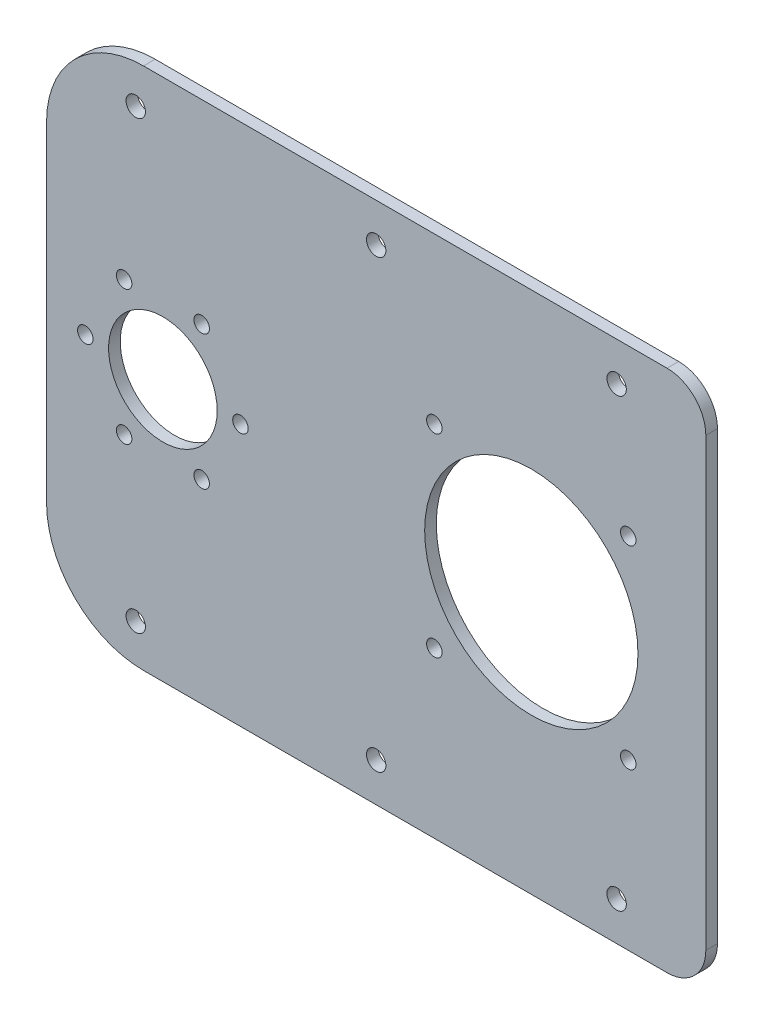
from build123d import *

# Parameters (mm, degrees)
SKETCH_1_W               = 170
SKETCH_1_H               = 135
SKETCH_1_R               = 14
EXTRUDE_1_DEPTH          = 1.5
CUT_EXTRUDE_1_DEPTH      = 109.551830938
CUT_EXTRUDE_1_DEPTH_BACK = 109.551830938
SKETCH_2_R               = 27.5
MM_1_D                   = 4
MM_1_DEPTH               = 6.5
MM_1_TIP                 = 1.201721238
SKETCH_5_R               = 2.5
SKETCH_5_R_2             = 2
CUT_EXTRUDE_2_DEPTH      = 109.582917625
FILLET_1_R               = 10
FILLET_2_R               = 25


with BuildPart() as part:
    # Sketch 1 → Extrude 1 (new, symmetric)
    with BuildSketch(Plane.XY):
        Rectangle(SKETCH_1_W, SKETCH_1_H)
        with Locations((-55, 0)):
            Circle(SKETCH_1_R, mode=Mode.SUBTRACT)
    extrude(amount=EXTRUDE_1_DEPTH, both=True)

    # Sketch 2 → Cut-Extrude 1 (cut, two sides: drawn at the far end of the back side and taken through both)
    with BuildSketch(Plane.XY.offset(-CUT_EXTRUDE_1_DEPTH_BACK)):
        with Locations((40, 0)):
            Circle(SKETCH_2_R)
    extrude(amount=CUT_EXTRUDE_1_DEPTH + CUT_EXTRUDE_1_DEPTH_BACK, mode=Mode.SUBTRACT)

    # mm _1
    with Locations(Plane(origin=(15, 25, 1.5), x_dir=(1, 0, 0), z_dir=(0, 0, 1))):
        with Locations((0, 0), (50, 0), (0, -50), (50, -50)):
            Hole(MM_1_D / 2, depth=MM_1_DEPTH)
            with Locations((0, 0, -(MM_1_DEPTH + MM_1_TIP / 2))):  # 118° drill point
                Cone(0, MM_1_D / 2, MM_1_TIP, mode=Mode.SUBTRACT)

    # Sketch 5 → Cut-Extrude 2 (cut, through all)
    with BuildSketch(Plane.XY.offset(1.5)):
        with Locations((62, 57.5)):
            Circle(SKETCH_5_R)
        with Locations((0, 57.5)):
            Circle(SKETCH_5_R)
        with Locations((-62, 57.5)):
            Circle(SKETCH_5_R)
        with Locations(Location((-62, -57.5, 0), (0, 0, 180))):
            Circle(SKETCH_5_R)
        with Locations(Location((0, -57.5, 0), (0, 0, 180))):
            Circle(SKETCH_5_R)
        with Locations(Location((62, -57.5, 0), (0, 0, 180))):
            Circle(SKETCH_5_R)
        with Locations((-75, 0)):
            Circle(SKETCH_5_R_2)
        with Locations((-35, 0)):
            Circle(SKETCH_5_R_2)
        with Locations((-65, -17.320508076)):
            Circle(SKETCH_5_R_2)
        with Locations((-45, 17.320508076)):
            Circle(SKETCH_5_R_2)
        with Locations((-45, -17.320508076)):
            Circle(SKETCH_5_R_2)
        with Locations((-65, 17.320508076)):
            Circle(SKETCH_5_R_2)
    extrude(amount=-CUT_EXTRUDE_2_DEPTH, mode=Mode.SUBTRACT)

    # Fillet 1
    fillet_1_edges = [part.edges().sort_by_distance(p)[0] for p in [
        (85, -67.5, 0),
        (85, 67.5, 0),
    ]]
    fillet(fillet_1_edges, radius=FILLET_1_R)

    # Fillet 2
    fillet_2_edges = [part.edges().sort_by_distance(p)[0] for p in [
        (-85, -67.5, 0),
        (-85, 67.5, 0),
    ]]
    fillet(fillet_2_edges, radius=FILLET_2_R)


solid = part.part
